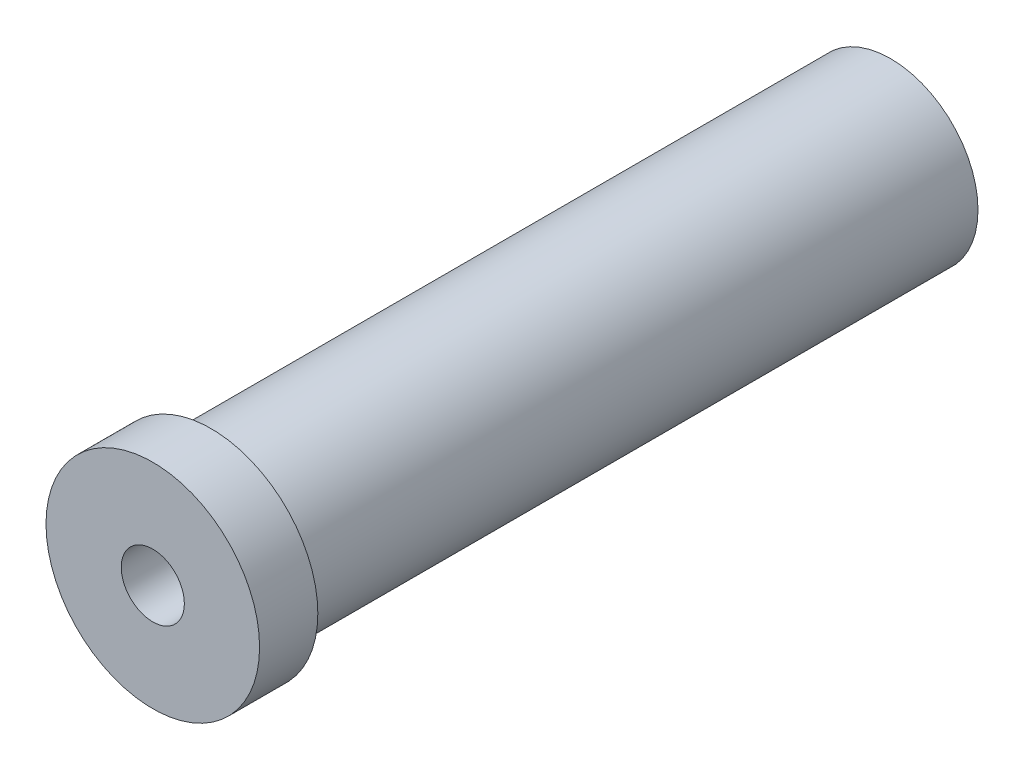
ISO-10303-21;
HEADER;
FILE_DESCRIPTION(('STEP AP214'),'2;1');
FILE_NAME('part.step','',(''),(''),'','','');
FILE_SCHEMA(('AUTOMOTIVE_DESIGN { 1 0 10303 214 1 1 1 1 }'));
ENDSEC;
DATA;
#1=APPLICATION_CONTEXT('core data for automotive mechanical design processes');
#2=APPLICATION_PROTOCOL_DEFINITION('international standard','automotive_design',2000,#1);
#3=PRODUCT_CONTEXT('',#1,'mechanical');
#4=PRODUCT('Part','Part','',(#3));
#5=PRODUCT_RELATED_PRODUCT_CATEGORY('part','',(#4));
#6=PRODUCT_DEFINITION_FORMATION('','',#4);
#7=PRODUCT_DEFINITION_CONTEXT('part definition',#1,'design');
#8=PRODUCT_DEFINITION('design','',#6,#7);
#9=PRODUCT_DEFINITION_SHAPE('','',#8);
#10=(LENGTH_UNIT() NAMED_UNIT(*) SI_UNIT(.MILLI.,.METRE.));
#11=(NAMED_UNIT(*) PLANE_ANGLE_UNIT() SI_UNIT($,.RADIAN.));
#12=(NAMED_UNIT(*) SI_UNIT($,.STERADIAN.) SOLID_ANGLE_UNIT());
#13=UNCERTAINTY_MEASURE_WITH_UNIT(LENGTH_MEASURE(1.E-05),#10,'distance_accuracy_value','');
#14=(GEOMETRIC_REPRESENTATION_CONTEXT(3) GLOBAL_UNCERTAINTY_ASSIGNED_CONTEXT((#13)) GLOBAL_UNIT_ASSIGNED_CONTEXT((#10,
#11,#12)) REPRESENTATION_CONTEXT('',''));
#15=CARTESIAN_POINT('',(0.,0.,0.));
#16=DIRECTION('',(0.,0.,1.));
#17=DIRECTION('',(1.,0.,0.));
#18=AXIS2_PLACEMENT_3D('',#15,#16,#17);
#19=CARTESIAN_POINT('',(0.,0.,0.));
#20=DIRECTION('',(0.,0.,1.));
#21=DIRECTION('',(1.,0.,0.));
#22=AXIS2_PLACEMENT_3D('',#19,#20,#21);
#23=CYLINDRICAL_SURFACE('',#22,11.);
#24=CARTESIAN_POINT('',(0.,0.,0.));
#25=DIRECTION('',(0.,0.,1.));
#26=DIRECTION('',(1.,0.,0.));
#27=AXIS2_PLACEMENT_3D('',#24,#25,#26);
#28=CIRCLE('',#27,11.);
#29=CARTESIAN_POINT('',(11.,0.,0.));
#30=VERTEX_POINT('',#29);
#31=EDGE_CURVE('E74',#30,#30,#28,.T.);
#32=ORIENTED_EDGE('',*,*,#31,.F.);
#33=EDGE_LOOP('',(#32));
#34=FACE_BOUND('',#33,.T.);
#35=CARTESIAN_POINT('',(0.,0.,-6.));
#36=DIRECTION('',(0.,0.,1.));
#37=DIRECTION('',(1.,0.,0.));
#38=AXIS2_PLACEMENT_3D('',#35,#36,#37);
#39=CIRCLE('',#38,11.);
#40=CARTESIAN_POINT('',(11.,0.,-6.));
#41=VERTEX_POINT('',#40);
#42=EDGE_CURVE('E77',#41,#41,#39,.T.);
#43=ORIENTED_EDGE('',*,*,#42,.T.);
#44=EDGE_LOOP('',(#43));
#45=FACE_BOUND('',#44,.T.);
#46=CARTESIAN_POINT('',(-11.,0.,-1.));
#47=CARTESIAN_POINT('',(-10.9999980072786,0.111357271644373,-1.00000431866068));
#48=CARTESIAN_POINT('',(-10.9982915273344,0.222771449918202,-1.00933175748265));
#49=CARTESIAN_POINT('',(-10.99164847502,0.442464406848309,-1.04637346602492));
#50=CARTESIAN_POINT('',(-10.9867091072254,0.550740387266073,-1.07410364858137));
#51=CARTESIAN_POINT('',(-10.9741532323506,0.760947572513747,-1.14707712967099));
#52=CARTESIAN_POINT('',(-10.9665390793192,0.862884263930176,-1.19230503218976));
#53=CARTESIAN_POINT('',(-10.949466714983,1.0577120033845,-1.29894733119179));
#54=CARTESIAN_POINT('',(-10.9400086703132,1.15060386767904,-1.36036026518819));
#55=CARTESIAN_POINT('',(-10.9201743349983,1.32576444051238,-1.4983659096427));
#56=CARTESIAN_POINT('',(-10.9097897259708,1.40791622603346,-1.57510584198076));
#57=CARTESIAN_POINT('',(-10.8893349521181,1.55825357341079,-1.74127035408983));
#58=CARTESIAN_POINT('',(-10.8792648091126,1.62643816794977,-1.83069581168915));
#59=CARTESIAN_POINT('',(-10.8604984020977,1.74738695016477,-2.02051272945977));
#60=CARTESIAN_POINT('',(-10.851812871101,1.80003313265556,-2.12098053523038));
#61=CARTESIAN_POINT('',(-10.836915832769,1.88765546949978,-2.32951865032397));
#62=CARTESIAN_POINT('',(-10.8307041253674,1.92263305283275,-2.43758834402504));
#63=CARTESIAN_POINT('',(-10.821541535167,1.97355197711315,-2.6570146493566));
#64=CARTESIAN_POINT('',(-10.8185558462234,1.98969666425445,-2.76832259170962));
#65=CARTESIAN_POINT('',(-10.8160783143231,2.00312248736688,-2.99210440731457));
#66=CARTESIAN_POINT('',(-10.8165861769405,2.00040521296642,-3.10457818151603));
#67=CARTESIAN_POINT('',(-10.8210066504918,1.97634934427,-3.32603191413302));
#68=CARTESIAN_POINT('',(-10.8248771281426,1.95524117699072,-3.43503786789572));
#69=CARTESIAN_POINT('',(-10.8355206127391,1.89536523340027,-3.64793501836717));
#70=CARTESIAN_POINT('',(-10.8422937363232,1.85659674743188,-3.75182600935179));
#71=CARTESIAN_POINT('',(-10.8580238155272,1.76227297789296,-3.95222279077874));
#72=CARTESIAN_POINT('',(-10.8669929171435,1.7066239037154,-4.04868344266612));
#73=CARTESIAN_POINT('',(-10.8860962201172,1.58018503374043,-4.23098473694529));
#74=CARTESIAN_POINT('',(-10.8962305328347,1.50939379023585,-4.31682436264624));
#75=CARTESIAN_POINT('',(-10.9167064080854,1.35343399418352,-4.47677899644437));
#76=CARTESIAN_POINT('',(-10.9270488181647,1.2680681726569,-4.55070168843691));
#77=CARTESIAN_POINT('',(-10.9466375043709,1.08604454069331,-4.68320513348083));
#78=CARTESIAN_POINT('',(-10.9558837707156,0.989386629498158,-4.74178574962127));
#79=CARTESIAN_POINT('',(-10.9722553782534,0.787327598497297,-4.84196738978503));
#80=CARTESIAN_POINT('',(-10.9793783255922,0.681916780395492,-4.88354926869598));
#81=CARTESIAN_POINT('',(-10.9906820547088,0.465448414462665,-4.9483631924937));
#82=CARTESIAN_POINT('',(-10.994863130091,0.354391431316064,-4.97159706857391));
#83=CARTESIAN_POINT('',(-10.9997719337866,0.131438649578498,-4.99878976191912));
#84=CARTESIAN_POINT('',(-11.0005468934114,0.019576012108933,-5.00301222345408));
#85=CARTESIAN_POINT('',(-10.998686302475,-0.203257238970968,-4.99276820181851));
#86=CARTESIAN_POINT('',(-10.9960509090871,-0.314227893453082,-4.97830257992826));
#87=CARTESIAN_POINT('',(-10.9876950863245,-0.531297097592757,-4.93131225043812));
#88=CARTESIAN_POINT('',(-10.9819973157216,-0.637425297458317,-4.89892013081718));
#89=CARTESIAN_POINT('',(-10.9681529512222,-0.84274471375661,-4.81713917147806));
#90=CARTESIAN_POINT('',(-10.9600061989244,-0.941935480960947,-4.7677492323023));
#91=CARTESIAN_POINT('',(-10.9420497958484,-1.13169524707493,-4.65278536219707));
#92=CARTESIAN_POINT('',(-10.932223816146,-1.22216445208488,-4.58704931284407));
#93=CARTESIAN_POINT('',(-10.9120428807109,-1.39088213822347,-4.44147962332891));
#94=CARTESIAN_POINT('',(-10.9016878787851,-1.46912954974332,-4.36164475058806));
#95=CARTESIAN_POINT('',(-10.8814603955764,-1.6121773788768,-4.18895311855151));
#96=CARTESIAN_POINT('',(-10.8715955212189,-1.67679836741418,-4.09594669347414));
#97=CARTESIAN_POINT('',(-10.8536151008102,-1.78949986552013,-3.90024381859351));
#98=CARTESIAN_POINT('',(-10.8454994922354,-1.83758096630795,-3.79754771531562));
#99=CARTESIAN_POINT('',(-10.8319954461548,-1.91557945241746,-3.58584925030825));
#100=CARTESIAN_POINT('',(-10.8265943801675,-1.9455810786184,-3.47687876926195));
#101=CARTESIAN_POINT('',(-10.8191012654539,-1.98683040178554,-3.25533701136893));
#102=CARTESIAN_POINT('',(-10.8170088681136,-1.99808007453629,-3.14276611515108));
#103=CARTESIAN_POINT('',(-10.8163869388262,-2.00144313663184,-2.91901462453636));
#104=CARTESIAN_POINT('',(-10.8178047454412,-1.99383937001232,-2.80783832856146));
#105=CARTESIAN_POINT('',(-10.8239270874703,-1.96032846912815,-2.58837636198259));
#106=CARTESIAN_POINT('',(-10.8286316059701,-1.93442142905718,-2.48009067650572));
#107=CARTESIAN_POINT('',(-10.8407757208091,-1.86515567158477,-2.26962380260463));
#108=CARTESIAN_POINT('',(-10.8482107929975,-1.82182581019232,-2.16743283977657));
#109=CARTESIAN_POINT('',(-10.8649817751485,-1.71897473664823,-1.97172555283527));
#110=CARTESIAN_POINT('',(-10.8743178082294,-1.65945247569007,-1.87820979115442));
#111=CARTESIAN_POINT('',(-10.8940032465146,-1.52491543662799,-1.70108712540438));
#112=CARTESIAN_POINT('',(-10.9043650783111,-1.44969415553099,-1.61763843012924));
#113=CARTESIAN_POINT('',(-10.9248399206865,-1.28632651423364,-1.46445291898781));
#114=CARTESIAN_POINT('',(-10.9349528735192,-1.19817718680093,-1.39471925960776));
#115=CARTESIAN_POINT('',(-10.9538897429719,-1.0105711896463,-1.27039970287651));
#116=CARTESIAN_POINT('',(-10.9627021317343,-0.911025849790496,-1.21594581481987));
#117=CARTESIAN_POINT('',(-10.9779326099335,-0.704073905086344,-1.12462078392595));
#118=CARTESIAN_POINT('',(-10.9843529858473,-0.59667492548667,-1.08773284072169));
#119=CARTESIAN_POINT('',(-10.9927407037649,-0.407441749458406,-1.04022456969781));
#120=CARTESIAN_POINT('',(-10.9954478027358,-0.32672542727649,-1.02516566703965));
#121=CARTESIAN_POINT('',(-10.9990781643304,-0.164016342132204,-1.0050519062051));
#122=CARTESIAN_POINT('',(-11.0000014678,-0.0820236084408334,-0.99999681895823));
#123=CARTESIAN_POINT('',(-11.,0.,-1.));
#124=B_SPLINE_CURVE_WITH_KNOTS('',3,(#46,#47,#48,#49,#50,#51,#52,#53,#54,#55,#56,#57,#58,#59,
#60,#61,#62,#63,#64,#65,#66,#67,#68,#69,#70,#71,#72,#73,#74,#75,#76,#77,#78,#79,#80,#81,#82,#83,
#84,#85,#86,#87,#88,#89,#90,#91,#92,#93,#94,#95,#96,#97,#98,#99,#100,#101,#102,#103,#104,#105,
#106,#107,#108,#109,#110,#111,#112,#113,#114,#115,#116,#117,#118,#119,#120,#121,#122,#123),
.UNSPECIFIED.,.T.,.F.,(4,2,2,2,2,2,2,2,2,2,2,2,2,2,2,2,2,2,2,2,2,2,2,2,2,2,2,2,2,2,2,2,2,2,2,2,
2,2,4),(0.,0.333771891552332,0.66783277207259,1.00160038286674,1.3353378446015,1.67245014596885,
2.00958578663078,2.3492195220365,2.6888257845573,3.02473021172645,3.36060633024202,
3.69233367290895,4.02407434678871,4.35769306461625,4.69134369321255,5.02993210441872,
5.36852353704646,5.70749527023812,6.04643316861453,6.38065600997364,6.71486344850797,
7.0466314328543,7.37842088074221,7.71364226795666,8.04889297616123,8.38831506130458,
8.72772501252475,9.06554101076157,9.40332141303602,9.73606509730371,10.0688070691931,
10.4010002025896,10.733214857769,11.0701111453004,11.4070848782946,11.7468860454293,
12.0863615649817,12.3322171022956,12.5780670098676),.UNSPECIFIED.);
#125=CARTESIAN_POINT('',(-11.,0.,-1.));
#126=VERTEX_POINT('',#125);
#127=EDGE_CURVE('E10',#126,#126,#124,.T.);
#128=ORIENTED_EDGE('',*,*,#127,.F.);
#129=EDGE_LOOP('',(#128));
#130=FACE_BOUND('',#129,.T.);
#131=ADVANCED_FACE('F16',(#34,#45,#130),#23,.T.);
#132=CARTESIAN_POINT('',(0.,3.25,-48.));
#133=DIRECTION('',(0.,0.,-1.));
#134=DIRECTION('',(-1.,0.,0.));
#135=AXIS2_PLACEMENT_3D('',#132,#133,#134);
#136=PLANE('',#135);
#137=CARTESIAN_POINT('',(0.,0.,-48.));
#138=DIRECTION('',(0.,0.,1.));
#139=DIRECTION('',(1.,0.,0.));
#140=AXIS2_PLACEMENT_3D('',#137,#138,#139);
#141=CIRCLE('',#140,3.);
#142=CARTESIAN_POINT('',(3.,0.,-48.));
#143=VERTEX_POINT('',#142);
#144=EDGE_CURVE('E100',#143,#143,#141,.T.);
#145=ORIENTED_EDGE('',*,*,#144,.F.);
#146=EDGE_LOOP('',(#145));
#147=FACE_BOUND('',#146,.T.);
#148=CARTESIAN_POINT('',(0.,0.,-48.));
#149=DIRECTION('',(0.,0.,1.));
#150=DIRECTION('',(1.,0.,0.));
#151=AXIS2_PLACEMENT_3D('',#148,#149,#150);
#152=CIRCLE('',#151,3.25);
#153=CARTESIAN_POINT('',(3.25,0.,-48.));
#154=VERTEX_POINT('',#153);
#155=EDGE_CURVE('E28',#154,#154,#152,.T.);
#156=ORIENTED_EDGE('',*,*,#155,.T.);
#157=EDGE_LOOP('',(#156));
#158=FACE_BOUND('',#157,.T.);
#159=ADVANCED_FACE('F18',(#147,#158),#136,.F.);
#160=CARTESIAN_POINT('',(0.,0.,0.));
#161=DIRECTION('',(0.,0.,1.));
#162=DIRECTION('',(1.,0.,0.));
#163=AXIS2_PLACEMENT_3D('',#160,#161,#162);
#164=CYLINDRICAL_SURFACE('',#163,3.25);
#165=ORIENTED_EDGE('',*,*,#155,.F.);
#166=EDGE_LOOP('',(#165));
#167=FACE_BOUND('',#166,.T.);
#168=CARTESIAN_POINT('',(0.,0.,0.));
#169=DIRECTION('',(0.,0.,1.));
#170=DIRECTION('',(1.,0.,0.));
#171=AXIS2_PLACEMENT_3D('',#168,#169,#170);
#172=CIRCLE('',#171,3.25);
#173=CARTESIAN_POINT('',(3.25,0.,0.));
#174=VERTEX_POINT('',#173);
#175=EDGE_CURVE('E73',#174,#174,#172,.T.);
#176=ORIENTED_EDGE('',*,*,#175,.T.);
#177=EDGE_LOOP('',(#176));
#178=FACE_BOUND('',#177,.T.);
#179=ADVANCED_FACE('F51',(#167,#178),#164,.F.);
#180=CARTESIAN_POINT('',(0.,3.25,0.));
#181=DIRECTION('',(0.,0.,-1.));
#182=DIRECTION('',(-1.,0.,0.));
#183=AXIS2_PLACEMENT_3D('',#180,#181,#182);
#184=PLANE('',#183);
#185=ORIENTED_EDGE('',*,*,#175,.F.);
#186=EDGE_LOOP('',(#185));
#187=FACE_BOUND('',#186,.T.);
#188=ORIENTED_EDGE('',*,*,#31,.T.);
#189=EDGE_LOOP('',(#188));
#190=FACE_BOUND('',#189,.T.);
#191=ADVANCED_FACE('F60',(#187,#190),#184,.F.);
#192=CARTESIAN_POINT('',(0.,11.,-6.));
#193=DIRECTION('',(0.,0.,1.));
#194=DIRECTION('',(1.,0.,0.));
#195=AXIS2_PLACEMENT_3D('',#192,#193,#194);
#196=PLANE('',#195);
#197=ORIENTED_EDGE('',*,*,#42,.F.);
#198=EDGE_LOOP('',(#197));
#199=FACE_BOUND('',#198,.T.);
#200=CARTESIAN_POINT('',(0.,0.,-6.));
#201=DIRECTION('',(0.,0.,1.));
#202=DIRECTION('',(1.,0.,0.));
#203=AXIS2_PLACEMENT_3D('',#200,#201,#202);
#204=CIRCLE('',#203,9.);
#205=CARTESIAN_POINT('',(9.,0.,-6.));
#206=VERTEX_POINT('',#205);
#207=EDGE_CURVE('E82',#206,#206,#204,.T.);
#208=ORIENTED_EDGE('',*,*,#207,.T.);
#209=EDGE_LOOP('',(#208));
#210=FACE_BOUND('',#209,.T.);
#211=ADVANCED_FACE('F58',(#199,#210),#196,.F.);
#212=CARTESIAN_POINT('',(0.,0.,0.));
#213=DIRECTION('',(0.,0.,1.));
#214=DIRECTION('',(1.,0.,0.));
#215=AXIS2_PLACEMENT_3D('',#212,#213,#214);
#216=CYLINDRICAL_SURFACE('',#215,9.);
#217=ORIENTED_EDGE('',*,*,#207,.F.);
#218=EDGE_LOOP('',(#217));
#219=FACE_BOUND('',#218,.T.);
#220=CARTESIAN_POINT('',(0.,0.,-76.));
#221=DIRECTION('',(0.,0.,1.));
#222=DIRECTION('',(1.,0.,0.));
#223=AXIS2_PLACEMENT_3D('',#220,#221,#222);
#224=CIRCLE('',#223,9.);
#225=CARTESIAN_POINT('',(9.,0.,-76.));
#226=VERTEX_POINT('',#225);
#227=EDGE_CURVE('E85',#226,#226,#224,.T.);
#228=ORIENTED_EDGE('',*,*,#227,.T.);
#229=EDGE_LOOP('',(#228));
#230=FACE_BOUND('',#229,.T.);
#231=ADVANCED_FACE('F132',(#219,#230),#216,.T.);
#232=CARTESIAN_POINT('',(0.,9.,-76.));
#233=DIRECTION('',(0.,0.,1.));
#234=DIRECTION('',(1.,0.,0.));
#235=AXIS2_PLACEMENT_3D('',#232,#233,#234);
#236=PLANE('',#235);
#237=ORIENTED_EDGE('',*,*,#227,.F.);
#238=EDGE_LOOP('',(#237));
#239=FACE_BOUND('',#238,.T.);
#240=CARTESIAN_POINT('',(0.,0.,-76.));
#241=DIRECTION('',(0.,0.,1.));
#242=DIRECTION('',(1.,0.,0.));
#243=AXIS2_PLACEMENT_3D('',#240,#241,#242);
#244=CIRCLE('',#243,3.1);
#245=CARTESIAN_POINT('',(3.1,0.,-76.));
#246=VERTEX_POINT('',#245);
#247=EDGE_CURVE('E88',#246,#246,#244,.T.);
#248=ORIENTED_EDGE('',*,*,#247,.T.);
#249=EDGE_LOOP('',(#248));
#250=FACE_BOUND('',#249,.T.);
#251=ADVANCED_FACE('F129',(#239,#250),#236,.F.);
#252=CARTESIAN_POINT('',(0.,0.,0.));
#253=DIRECTION('',(0.,0.,1.));
#254=DIRECTION('',(1.,0.,0.));
#255=AXIS2_PLACEMENT_3D('',#252,#253,#254);
#256=CYLINDRICAL_SURFACE('',#255,3.1);
#257=ORIENTED_EDGE('',*,*,#247,.F.);
#258=EDGE_LOOP('',(#257));
#259=FACE_BOUND('',#258,.T.);
#260=CARTESIAN_POINT('',(0.,0.,-74.));
#261=DIRECTION('',(0.,0.,1.));
#262=DIRECTION('',(1.,0.,0.));
#263=AXIS2_PLACEMENT_3D('',#260,#261,#262);
#264=CIRCLE('',#263,3.1);
#265=CARTESIAN_POINT('',(3.1,0.,-74.));
#266=VERTEX_POINT('',#265);
#267=EDGE_CURVE('E91',#266,#266,#264,.T.);
#268=ORIENTED_EDGE('',*,*,#267,.T.);
#269=EDGE_LOOP('',(#268));
#270=FACE_BOUND('',#269,.T.);
#271=ADVANCED_FACE('F125',(#259,#270),#256,.F.);
#272=CARTESIAN_POINT('',(0.,0.,-69.));
#273=DIRECTION('',(0.,0.,1.));
#274=DIRECTION('',(1.,0.,0.));
#275=AXIS2_PLACEMENT_3D('',#272,#273,#274);
#276=CONICAL_SURFACE('',#275,3.53744331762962,0.0872664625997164);
#277=ORIENTED_EDGE('',*,*,#267,.F.);
#278=EDGE_LOOP('',(#277));
#279=FACE_BOUND('',#278,.T.);
#280=CARTESIAN_POINT('',(0.,0.,-69.));
#281=DIRECTION('',(0.,0.,1.));
#282=DIRECTION('',(1.,0.,0.));
#283=AXIS2_PLACEMENT_3D('',#280,#281,#282);
#284=CIRCLE('',#283,3.53744331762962);
#285=CARTESIAN_POINT('',(3.53744331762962,0.,-69.));
#286=VERTEX_POINT('',#285);
#287=EDGE_CURVE('E94',#286,#286,#284,.T.);
#288=ORIENTED_EDGE('',*,*,#287,.T.);
#289=EDGE_LOOP('',(#288));
#290=FACE_BOUND('',#289,.T.);
#291=ADVANCED_FACE('F118',(#279,#290),#276,.F.);
#292=CARTESIAN_POINT('',(0.,3.53744331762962,-69.));
#293=DIRECTION('',(0.,0.,1.));
#294=DIRECTION('',(1.,0.,0.));
#295=AXIS2_PLACEMENT_3D('',#292,#293,#294);
#296=PLANE('',#295);
#297=ORIENTED_EDGE('',*,*,#287,.F.);
#298=EDGE_LOOP('',(#297));
#299=FACE_BOUND('',#298,.T.);
#300=CARTESIAN_POINT('',(0.,0.,-69.));
#301=DIRECTION('',(0.,0.,1.));
#302=DIRECTION('',(1.,0.,0.));
#303=AXIS2_PLACEMENT_3D('',#300,#301,#302);
#304=CIRCLE('',#303,3.);
#305=CARTESIAN_POINT('',(3.,0.,-69.));
#306=VERTEX_POINT('',#305);
#307=EDGE_CURVE('E97',#306,#306,#304,.T.);
#308=ORIENTED_EDGE('',*,*,#307,.T.);
#309=EDGE_LOOP('',(#308));
#310=FACE_BOUND('',#309,.T.);
#311=ADVANCED_FACE('F112',(#299,#310),#296,.F.);
#312=CARTESIAN_POINT('',(0.,0.,0.));
#313=DIRECTION('',(0.,0.,1.));
#314=DIRECTION('',(1.,0.,0.));
#315=AXIS2_PLACEMENT_3D('',#312,#313,#314);
#316=CYLINDRICAL_SURFACE('',#315,3.);
#317=ORIENTED_EDGE('',*,*,#307,.F.);
#318=EDGE_LOOP('',(#317));
#319=FACE_BOUND('',#318,.T.);
#320=ORIENTED_EDGE('',*,*,#144,.T.);
#321=EDGE_LOOP('',(#320));
#322=FACE_BOUND('',#321,.T.);
#323=ADVANCED_FACE('F41',(#319,#322),#316,.F.);
#324=CARTESIAN_POINT('',(-11.,0.,-3.));
#325=DIRECTION('',(-1.,0.,0.));
#326=DIRECTION('',(0.,0.,1.));
#327=AXIS2_PLACEMENT_3D('',#324,#325,#326);
#328=CYLINDRICAL_SURFACE('',#327,2.);
#329=CARTESIAN_POINT('',(-6.5,0.,-3.));
#330=DIRECTION('',(-1.,0.,0.));
#331=DIRECTION('',(0.,0.,1.));
#332=AXIS2_PLACEMENT_3D('',#329,#330,#331);
#333=CIRCLE('',#332,2.);
#334=CARTESIAN_POINT('',(-6.5,0.,-1.));
#335=VERTEX_POINT('',#334);
#336=EDGE_CURVE('E103',#335,#335,#333,.T.);
#337=ORIENTED_EDGE('',*,*,#336,.F.);
#338=EDGE_LOOP('',(#337));
#339=FACE_BOUND('',#338,.T.);
#340=ORIENTED_EDGE('',*,*,#127,.T.);
#341=EDGE_LOOP('',(#340));
#342=FACE_BOUND('',#341,.T.);
#343=ADVANCED_FACE('F33',(#339,#342),#328,.F.);
#344=CARTESIAN_POINT('',(-5.34529946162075,0.,-3.));
#345=DIRECTION('',(-1.,0.,0.));
#346=DIRECTION('',(0.,0.,1.));
#347=AXIS2_PLACEMENT_3D('',#344,#345,#346);
#348=CONICAL_SURFACE('',#347,0.,1.0471975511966);
#349=ORIENTED_EDGE('',*,*,#336,.T.);
#350=EDGE_LOOP('',(#349));
#351=FACE_BOUND('',#350,.T.);
#352=CARTESIAN_POINT('',(-5.34529946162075,0.,-3.));
#353=VERTEX_POINT('',#352);
#354=VERTEX_LOOP('',#353);
#355=FACE_BOUND('',#354,.T.);
#356=ADVANCED_FACE('F31',(#351,#355),#348,.F.);
#357=CLOSED_SHELL('',(#131,#159,#179,#191,#211,#231,#251,#271,#291,#311,#323,#343,#356));
#358=MANIFOLD_SOLID_BREP('B1',#357);
#359=ADVANCED_BREP_SHAPE_REPRESENTATION('',(#18,#358),#14);
#360=SHAPE_DEFINITION_REPRESENTATION(#9,#359);
ENDSEC;
END-ISO-10303-21;
